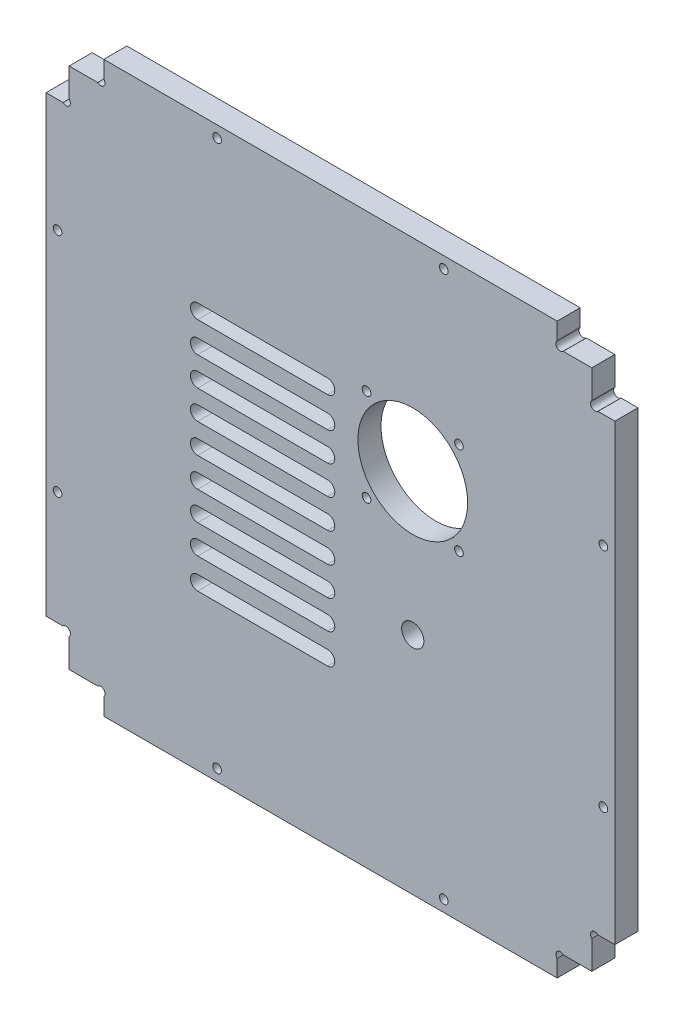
from build123d import *

# Parameters (mm, degrees)
ESQUISSE1_R             = 1.5
BOSS_EXTRU_1_DEPTH      = 8
ESQUISSE2_R             = 18.999999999
ESQUISSE2_R_2           = 1.499999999
ESQUISSE2_R_3           = 3.85
ENL_V_MAT_EXTRU_1_DEPTH = 343.361819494
ESQUISSE4_R             = 1
ENL_V_MAT_EXTRU_2_DEPTH = 3


with BuildPart() as part:
    # Esquisse1 → Boss.-Extru.1 (new body)
    with BuildSketch(Plane.XY):
        with BuildLine():
            Line((-299.031955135, -146.515780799), (-293.153275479, -146.515780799))
            ThreePointArc((-293.153275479, -146.515780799), (-291.031955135, -146.515780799), (-291.031955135, -148.637101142))
            Line((-291.031955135, -148.637101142), (-291.031955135, -158.515780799))
            Line((-291.031955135, -158.515780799), (-281.153275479, -158.515780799))
            ThreePointArc((-281.153275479, -158.515780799), (-279.031955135, -158.515780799), (-279.031955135, -160.637101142))
            Line((-279.031955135, -160.637101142), (-279.031955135, -166.515780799))
            Line((-279.031955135, -166.515780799), (-122.031955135, -166.515780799))
            Line((-122.031955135, -166.515780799), (-122.031955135, -160.637101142))
            ThreePointArc((-122.031955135, -160.637101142), (-122.031955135, -158.515780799), (-119.910634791, -158.515780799))
            Line((-119.910634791, -158.515780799), (-110.031955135, -158.515780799))
            Line((-110.031955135, -158.515780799), (-110.031955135, -148.637101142))
            ThreePointArc((-110.031955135, -148.637101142), (-110.031955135, -146.515780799), (-107.910634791, -146.515780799))
            Line((-107.910634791, -146.515780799), (-102.031955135, -146.515780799))
            Line((-102.031955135, -146.515780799), (-102.031955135, -89.515780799))
            Line((-102.031955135, -89.515780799), (-102.031955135, 10.484219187))
            Line((-102.031955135, 10.484219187), (-107.910634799, 10.484219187))
            ThreePointArc((-107.910634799, 10.484219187), (-110.031955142, 10.484219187), (-110.031955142, 12.60553953))
            Line((-110.031955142, 12.60553953), (-110.031955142, 22.484219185))
            Line((-110.031955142, 22.484219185), (-119.910634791, 22.484219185))
            ThreePointArc((-119.910634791, 22.484219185), (-122.031955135, 22.484219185), (-122.031955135, 24.605539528))
            Line((-122.031955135, 24.605539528), (-122.031955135, 30.484219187))
            Line((-122.031955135, 30.484219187), (-279.031955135, 30.484219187))
            Line((-279.031955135, 30.484219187), (-279.031955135, 24.60553953))
            ThreePointArc((-279.031955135, 24.60553953), (-279.031955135, 22.484219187), (-281.153275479, 22.484219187))
            Line((-281.153275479, 22.484219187), (-291.031955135, 22.484219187))
            Line((-291.031955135, 22.484219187), (-291.031955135, 12.60553953))
            ThreePointArc((-291.031955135, 12.60553953), (-291.031955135, 10.484219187), (-293.153275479, 10.484219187))
            Line((-293.153275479, 10.484219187), (-299.031955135, 10.484219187))
            Line((-299.031955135, 10.484219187), (-299.031955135, -89.515780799))
            Line((-299.031955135, -89.515780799), (-299.031955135, -146.515780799))
        make_face()
        with Locations((-295.031955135, -107.265780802)):
            Circle(ESQUISSE1_R, mode=Mode.SUBTRACT)
        with Locations((-239.781955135, -162.515780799)):
            Circle(ESQUISSE1_R, mode=Mode.SUBTRACT)
        with Locations((-161.281955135, -162.515780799)):
            Circle(ESQUISSE1_R, mode=Mode.SUBTRACT)
        with Locations((-106.031955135, -107.265780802)):
            Circle(ESQUISSE1_R, mode=Mode.SUBTRACT)
        with Locations((-106.031955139, -28.76578081)):
            Circle(ESQUISSE1_R, mode=Mode.SUBTRACT)
        with Locations((-161.281955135, 26.484219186)):
            Circle(ESQUISSE1_R, mode=Mode.SUBTRACT)
        with Locations((-239.781955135, 26.484219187)):
            Circle(ESQUISSE1_R, mode=Mode.SUBTRACT)
        with Locations((-295.031955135, -28.76578081)):
            Circle(ESQUISSE1_R, mode=Mode.SUBTRACT)
    extrude(amount=BOSS_EXTRU_1_DEPTH)

    # Esquisse2 → Enl_v. mat.-Extru.1 (cut, through all)
    with BuildSketch(Plane.XY.offset(8)):
        with Locations((-172.031955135, -39.515780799)):
            Circle(ESQUISSE2_R)
        with Locations((-188.031955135, -55.515780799)):
            Circle(ESQUISSE2_R_2)
        with Locations((-156.031955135, -55.515780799)):
            Circle(ESQUISSE2_R_2)
        with Locations((-156.031955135, -23.515780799)):
            Circle(ESQUISSE2_R_2)
        with Locations((-188.031955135, -23.515780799)):
            Circle(ESQUISSE2_R_2)
        with Locations((-172.031955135, -88.615780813)):
            Circle(ESQUISSE2_R_3)
        with BuildLine():
            Line((-246.531955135, -97.195780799), (-201.531955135, -97.195780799))
            ThreePointArc((-201.531955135, -97.195780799), (-199.031955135, -99.695780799), (-201.531955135, -102.195780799))
            Line((-201.531955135, -102.195780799), (-246.531955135, -102.195780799))
            ThreePointArc((-246.531955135, -102.195780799), (-249.031955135, -99.695780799), (-246.531955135, -97.195780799))
        make_face()
        with BuildLine():
            Line((-246.531955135, -87.195780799), (-201.531955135, -87.195780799))
            ThreePointArc((-201.531955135, -87.195780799), (-199.031955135, -89.695780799), (-201.531955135, -92.195780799))
            Line((-201.531955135, -92.195780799), (-246.531955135, -92.195780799))
            ThreePointArc((-246.531955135, -92.195780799), (-249.031955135, -89.695780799), (-246.531955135, -87.195780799))
        make_face()
        with BuildLine():
            Line((-246.531955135, -77.195780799), (-201.531955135, -77.195780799))
            ThreePointArc((-201.531955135, -77.195780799), (-199.031955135, -79.695780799), (-201.531955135, -82.195780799))
            Line((-201.531955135, -82.195780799), (-246.531955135, -82.195780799))
            ThreePointArc((-246.531955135, -82.195780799), (-249.031955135, -79.695780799), (-246.531955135, -77.195780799))
        make_face()
        with BuildLine():
            Line((-246.53195515, -107.715780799), (-201.531955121, -107.715780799))
            ThreePointArc((-201.531955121, -107.715780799), (-199.031955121, -110.215780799), (-201.531955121, -112.715780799))
            Line((-201.531955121, -112.715780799), (-246.53195515, -112.715780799))
            ThreePointArc((-246.53195515, -112.715780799), (-249.03195515, -110.215780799), (-246.53195515, -107.715780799))
        make_face()
        with BuildLine():
            Line((-246.53195515, -31.315780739), (-201.531955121, -31.315780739))
            ThreePointArc((-201.531955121, -31.315780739), (-199.031955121, -28.815780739), (-201.531955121, -26.315780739))
            Line((-201.531955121, -26.315780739), (-246.53195515, -26.315780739))
            ThreePointArc((-246.53195515, -26.315780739), (-249.03195515, -28.815780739), (-246.53195515, -31.315780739))
        make_face()
        with BuildLine():
            Line((-246.531955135, -61.835780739), (-201.531955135, -61.835780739))
            ThreePointArc((-201.531955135, -61.835780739), (-199.031955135, -59.335780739), (-201.531955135, -56.835780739))
            Line((-201.531955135, -56.835780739), (-246.531955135, -56.835780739))
            ThreePointArc((-246.531955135, -56.835780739), (-249.031955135, -59.335780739), (-246.531955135, -61.835780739))
        make_face()
        with BuildLine():
            Line((-246.531955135, -51.835780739), (-201.531955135, -51.835780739))
            ThreePointArc((-201.531955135, -51.835780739), (-199.031955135, -49.335780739), (-201.531955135, -46.835780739))
            Line((-201.531955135, -46.835780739), (-246.531955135, -46.835780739))
            ThreePointArc((-246.531955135, -46.835780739), (-249.031955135, -49.335780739), (-246.531955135, -51.835780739))
        make_face()
        with BuildLine():
            Line((-246.531955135, -41.835780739), (-201.531955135, -41.835780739))
            ThreePointArc((-201.531955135, -41.835780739), (-199.031955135, -39.335780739), (-201.531955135, -36.835780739))
            Line((-201.531955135, -36.835780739), (-246.531955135, -36.835780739))
            ThreePointArc((-246.531955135, -36.835780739), (-249.031955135, -39.335780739), (-246.531955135, -41.835780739))
        make_face()
        with BuildLine():
            Line((-246.531955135, -67.015780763), (-201.531955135, -67.015780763))
            ThreePointArc((-201.531955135, -67.015780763), (-199.031955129, -69.515780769), (-201.531955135, -72.015780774))
            Line((-201.531955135, -72.015780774), (-246.531955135, -72.015780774))
            ThreePointArc((-246.531955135, -72.015780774), (-249.031955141, -69.515780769), (-246.531955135, -67.015780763))
        make_face()
    extrude(amount=-ENL_V_MAT_EXTRU_1_DEPTH, mode=Mode.SUBTRACT)

    # Esquisse4 → Enl_v. mat.-Extru.2 (cut)
    with BuildSketch(Plane(origin=(0, 0, 0), x_dir=(-1, 0, 0), z_dir=(0, 0, -1))):
        with Locations((181.031955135, -88.615780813)):
            Circle(ESQUISSE4_R)
        with Locations((172.031955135, -79.615780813)):
            Circle(ESQUISSE4_R)
        with Locations((163.031955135, -88.615780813)):
            Circle(ESQUISSE4_R)
    extrude(amount=-ENL_V_MAT_EXTRU_2_DEPTH, mode=Mode.SUBTRACT)


solid = part.part
